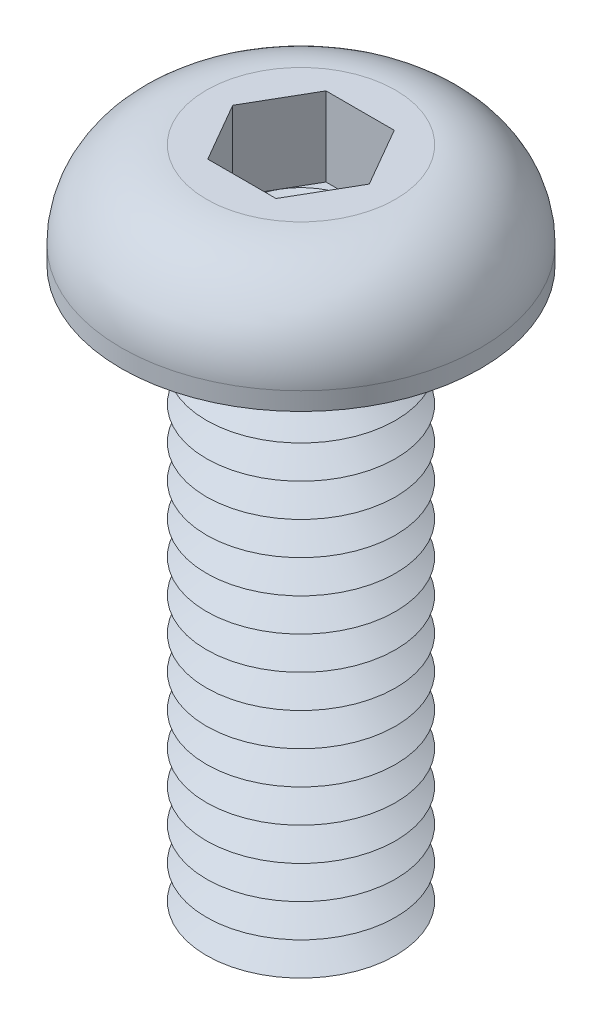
ISO-10303-21;
HEADER;
FILE_DESCRIPTION(('STEP AP214'),'2;1');
FILE_NAME('part.step','',(''),(''),'','','');
FILE_SCHEMA(('AUTOMOTIVE_DESIGN { 1 0 10303 214 1 1 1 1 }'));
ENDSEC;
DATA;
#1=APPLICATION_CONTEXT('core data for automotive mechanical design processes');
#2=APPLICATION_PROTOCOL_DEFINITION('international standard','automotive_design',2000,#1);
#3=PRODUCT_CONTEXT('',#1,'mechanical');
#4=PRODUCT('Part','Part','',(#3));
#5=PRODUCT_RELATED_PRODUCT_CATEGORY('part','',(#4));
#6=PRODUCT_DEFINITION_FORMATION('','',#4);
#7=PRODUCT_DEFINITION_CONTEXT('part definition',#1,'design');
#8=PRODUCT_DEFINITION('design','',#6,#7);
#9=PRODUCT_DEFINITION_SHAPE('','',#8);
#10=(LENGTH_UNIT() NAMED_UNIT(*) SI_UNIT(.MILLI.,.METRE.));
#11=(NAMED_UNIT(*) PLANE_ANGLE_UNIT() SI_UNIT($,.RADIAN.));
#12=(NAMED_UNIT(*) SI_UNIT($,.STERADIAN.) SOLID_ANGLE_UNIT());
#13=UNCERTAINTY_MEASURE_WITH_UNIT(LENGTH_MEASURE(1.E-05),#10,'distance_accuracy_value','');
#14=(GEOMETRIC_REPRESENTATION_CONTEXT(3) GLOBAL_UNCERTAINTY_ASSIGNED_CONTEXT((#13)) GLOBAL_UNIT_ASSIGNED_CONTEXT((#10,
#11,#12)) REPRESENTATION_CONTEXT('',''));
#15=CARTESIAN_POINT('',(0.,0.,0.));
#16=DIRECTION('',(0.,0.,1.));
#17=DIRECTION('',(1.,0.,0.));
#18=AXIS2_PLACEMENT_3D('',#15,#16,#17);
#19=CARTESIAN_POINT('',(0.,0.,0.));
#20=DIRECTION('',(0.,-1.,0.));
#21=DIRECTION('',(0.,0.,-1.));
#22=AXIS2_PLACEMENT_3D('',#19,#20,#21);
#23=TOROIDAL_SURFACE('',#22,2.35,0.35);
#24=CARTESIAN_POINT('',(0.,0.,-2.7));
#25=VERTEX_POINT('',#24);
#26=VERTEX_LOOP('',#25);
#27=FACE_BOUND('',#26,.T.);
#28=ADVANCED_FACE('P0_F12',(#27),#23,.T.);
#29=CLOSED_SHELL('',(#28));
#30=MANIFOLD_SOLID_BREP('P0_B1',#29);
#31=CARTESIAN_POINT('',(0.721687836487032,0.530000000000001,-1.25));
#32=DIRECTION('',(0.,1.,0.));
#33=DIRECTION('',(0.,0.,1.));
#34=AXIS2_PLACEMENT_3D('',#31,#32,#33);
#35=PLANE('',#34);
#36=CARTESIAN_POINT('',(0.,0.530000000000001,0.));
#37=DIRECTION('',(0.,1.,0.));
#38=DIRECTION('',(0.,0.,1.));
#39=AXIS2_PLACEMENT_3D('',#36,#37,#38);
#40=CIRCLE('',#39,1.25);
#41=CARTESIAN_POINT('',(0.,0.530000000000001,1.25));
#42=VERTEX_POINT('',#41);
#43=CARTESIAN_POINT('',(1.08253175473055,0.530000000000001,0.625));
#44=VERTEX_POINT('',#43);
#45=EDGE_CURVE('P1_E93',#42,#44,#40,.T.);
#46=ORIENTED_EDGE('',*,*,#45,.F.);
#47=DIRECTION('',(1.,0.,0.));
#48=VECTOR('',#47,1.);
#49=CARTESIAN_POINT('',(-0.721687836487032,0.530000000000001,1.25));
#50=LINE('',#49,#48);
#51=CARTESIAN_POINT('',(0.721687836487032,0.530000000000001,1.25));
#52=VERTEX_POINT('',#51);
#53=EDGE_CURVE('P1_E116',#42,#52,#50,.T.);
#54=ORIENTED_EDGE('',*,*,#53,.T.);
#55=DIRECTION('',(0.5,0.,-0.866025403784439));
#56=VECTOR('',#55,1.);
#57=CARTESIAN_POINT('',(0.721687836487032,0.530000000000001,1.25));
#58=LINE('',#57,#56);
#59=EDGE_CURVE('P1_E112',#52,#44,#58,.T.);
#60=ORIENTED_EDGE('',*,*,#59,.T.);
#61=EDGE_LOOP('',(#46,#54,#60));
#62=FACE_BOUND('',#61,.T.);
#63=ADVANCED_FACE('P1_F15',(#62),#35,.T.);
#64=CARTESIAN_POINT('',(0.,0.530000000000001,0.));
#65=DIRECTION('',(0.,1.,0.));
#66=DIRECTION('',(0.,0.,1.));
#67=AXIS2_PLACEMENT_3D('',#64,#65,#66);
#68=CIRCLE('',#67,1.25);
#69=CARTESIAN_POINT('',(1.08253175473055,0.530000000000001,-0.625));
#70=VERTEX_POINT('',#69);
#71=EDGE_CURVE('P1_E10',#44,#70,#68,.T.);
#72=ORIENTED_EDGE('',*,*,#71,.F.);
#73=CARTESIAN_POINT('',(1.44337567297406,0.530000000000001,0.));
#74=VERTEX_POINT('',#73);
#75=EDGE_CURVE('P1_E104',#44,#74,#58,.T.);
#76=ORIENTED_EDGE('',*,*,#75,.T.);
#77=DIRECTION('',(-0.5,0.,-0.866025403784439));
#78=VECTOR('',#77,1.);
#79=CARTESIAN_POINT('',(1.44337567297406,0.530000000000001,0.));
#80=LINE('',#79,#78);
#81=EDGE_CURVE('P1_E107',#74,#70,#80,.T.);
#82=ORIENTED_EDGE('',*,*,#81,.T.);
#83=EDGE_LOOP('',(#72,#76,#82));
#84=FACE_BOUND('',#83,.T.);
#85=ADVANCED_FACE('P1_F103',(#84),#35,.T.);
#86=CARTESIAN_POINT('',(0.,0.530000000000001,-1.25));
#87=VERTEX_POINT('',#86);
#88=EDGE_CURVE('P1_E24',#70,#87,#68,.T.);
#89=ORIENTED_EDGE('',*,*,#88,.F.);
#90=CARTESIAN_POINT('',(0.721687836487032,0.530000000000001,-1.25));
#91=VERTEX_POINT('',#90);
#92=EDGE_CURVE('P1_E139',#70,#91,#80,.T.);
#93=ORIENTED_EDGE('',*,*,#92,.T.);
#94=DIRECTION('',(-1.,0.,0.));
#95=VECTOR('',#94,1.);
#96=CARTESIAN_POINT('',(0.721687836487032,0.530000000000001,-1.25));
#97=LINE('',#96,#95);
#98=EDGE_CURVE('P1_E318',#91,#87,#97,.T.);
#99=ORIENTED_EDGE('',*,*,#98,.T.);
#100=EDGE_LOOP('',(#89,#93,#99));
#101=FACE_BOUND('',#100,.T.);
#102=ADVANCED_FACE('P1_F283',(#101),#35,.T.);
#103=CARTESIAN_POINT('',(-1.08253175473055,0.530000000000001,-0.625));
#104=VERTEX_POINT('',#103);
#105=EDGE_CURVE('P1_E313',#87,#104,#68,.T.);
#106=ORIENTED_EDGE('',*,*,#105,.F.);
#107=CARTESIAN_POINT('',(-0.721687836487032,0.530000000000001,-1.25));
#108=VERTEX_POINT('',#107);
#109=EDGE_CURVE('P1_E322',#87,#108,#97,.T.);
#110=ORIENTED_EDGE('',*,*,#109,.T.);
#111=DIRECTION('',(-0.5,0.,0.866025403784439));
#112=VECTOR('',#111,1.);
#113=CARTESIAN_POINT('',(-0.721687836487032,0.530000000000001,-1.25));
#114=LINE('',#113,#112);
#115=EDGE_CURVE('P1_E317',#108,#104,#114,.T.);
#116=ORIENTED_EDGE('',*,*,#115,.T.);
#117=EDGE_LOOP('',(#106,#110,#116));
#118=FACE_BOUND('',#117,.T.);
#119=ADVANCED_FACE('P1_F297',(#118),#35,.T.);
#120=CARTESIAN_POINT('',(-1.08253175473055,0.530000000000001,0.625));
#121=VERTEX_POINT('',#120);
#122=EDGE_CURVE('P1_E31',#104,#121,#68,.T.);
#123=ORIENTED_EDGE('',*,*,#122,.F.);
#124=CARTESIAN_POINT('',(-1.44337567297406,0.530000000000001,0.));
#125=VERTEX_POINT('',#124);
#126=EDGE_CURVE('P1_E309',#104,#125,#114,.T.);
#127=ORIENTED_EDGE('',*,*,#126,.T.);
#128=DIRECTION('',(0.5,0.,0.866025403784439));
#129=VECTOR('',#128,1.);
#130=CARTESIAN_POINT('',(-1.44337567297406,0.530000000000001,0.));
#131=LINE('',#130,#129);
#132=EDGE_CURVE('P1_E312',#125,#121,#131,.T.);
#133=ORIENTED_EDGE('',*,*,#132,.T.);
#134=EDGE_LOOP('',(#123,#127,#133));
#135=FACE_BOUND('',#134,.T.);
#136=ADVANCED_FACE('P1_F288',(#135),#35,.T.);
#137=CARTESIAN_POINT('',(0.,-11.3,0.));
#138=DIRECTION('',(0.,1.,0.));
#139=DIRECTION('',(0.,0.,1.));
#140=AXIS2_PLACEMENT_3D('',#137,#138,#139);
#141=CONICAL_SURFACE('',#140,1.39378221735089,1.0471975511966);
#142=CARTESIAN_POINT('',(0.,-10.95,0.));
#143=DIRECTION('',(0.,-1.,0.));
#144=DIRECTION('',(0.,0.,-1.));
#145=AXIS2_PLACEMENT_3D('',#142,#143,#144);
#146=CIRCLE('',#145,2.);
#147=CARTESIAN_POINT('',(0.,-10.95,-2.));
#148=VERTEX_POINT('',#147);
#149=EDGE_CURVE('P1_E245',#148,#148,#146,.T.);
#150=ORIENTED_EDGE('',*,*,#149,.T.);
#151=EDGE_LOOP('',(#150));
#152=FACE_BOUND('',#151,.T.);
#153=CARTESIAN_POINT('',(0.,-11.3,0.));
#154=DIRECTION('',(0.,-1.,0.));
#155=DIRECTION('',(0.,0.,-1.));
#156=AXIS2_PLACEMENT_3D('',#153,#154,#155);
#157=CIRCLE('',#156,1.39378221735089);
#158=CARTESIAN_POINT('',(0.,-11.3,-1.39378221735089));
#159=VERTEX_POINT('',#158);
#160=EDGE_CURVE('P1_E248',#159,#159,#157,.T.);
#161=ORIENTED_EDGE('',*,*,#160,.F.);
#162=EDGE_LOOP('',(#161));
#163=FACE_BOUND('',#162,.T.);
#164=ADVANCED_FACE('P1_F296',(#152,#163),#141,.T.);
#165=CARTESIAN_POINT('',(0.,-11.65,0.));
#166=DIRECTION('',(0.,-1.,0.));
#167=DIRECTION('',(0.,0.,-1.));
#168=AXIS2_PLACEMENT_3D('',#165,#166,#167);
#169=CONICAL_SURFACE('',#168,2.,1.0471975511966);
#170=ORIENTED_EDGE('',*,*,#160,.T.);
#171=EDGE_LOOP('',(#170));
#172=FACE_BOUND('',#171,.T.);
#173=CARTESIAN_POINT('',(0.,-11.65,0.));
#174=DIRECTION('',(0.,-1.,0.));
#175=DIRECTION('',(0.,0.,-1.));
#176=AXIS2_PLACEMENT_3D('',#173,#174,#175);
#177=CIRCLE('',#176,2.);
#178=CARTESIAN_POINT('',(0.,-11.65,-2.));
#179=VERTEX_POINT('',#178);
#180=EDGE_CURVE('P1_E251',#179,#179,#177,.T.);
#181=ORIENTED_EDGE('',*,*,#180,.F.);
#182=EDGE_LOOP('',(#181));
#183=FACE_BOUND('',#182,.T.);
#184=ADVANCED_FACE('P1_F303',(#172,#183),#169,.T.);
#185=CARTESIAN_POINT('',(0.,-12.,0.));
#186=DIRECTION('',(0.,1.,0.));
#187=DIRECTION('',(0.,0.,1.));
#188=AXIS2_PLACEMENT_3D('',#185,#186,#187);
#189=PLANE('',#188);
#190=CARTESIAN_POINT('',(0.,-12.,0.));
#191=DIRECTION('',(0.,-1.,0.));
#192=DIRECTION('',(0.,0.,-1.));
#193=AXIS2_PLACEMENT_3D('',#190,#191,#192);
#194=CIRCLE('',#193,1.39378221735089);
#195=CARTESIAN_POINT('',(0.,-12.,-1.39378221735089));
#196=VERTEX_POINT('',#195);
#197=EDGE_CURVE('P1_E254',#196,#196,#194,.T.);
#198=ORIENTED_EDGE('',*,*,#197,.T.);
#199=EDGE_LOOP('',(#198));
#200=FACE_BOUND('',#199,.T.);
#201=ADVANCED_FACE('P1_F381',(#200),#189,.F.);
#202=CARTESIAN_POINT('',(0.,-12.,0.));
#203=DIRECTION('',(0.,1.,0.));
#204=DIRECTION('',(0.,0.,1.));
#205=AXIS2_PLACEMENT_3D('',#202,#203,#204);
#206=CONICAL_SURFACE('',#205,1.39378221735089,1.0471975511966);
#207=ORIENTED_EDGE('',*,*,#180,.T.);
#208=EDGE_LOOP('',(#207));
#209=FACE_BOUND('',#208,.T.);
#210=ORIENTED_EDGE('',*,*,#197,.F.);
#211=EDGE_LOOP('',(#210));
#212=FACE_BOUND('',#211,.T.);
#213=ADVANCED_FACE('P1_F392',(#209,#212),#206,.T.);
#214=CARTESIAN_POINT('',(0.,-10.6,0.));
#215=DIRECTION('',(0.,1.,0.));
#216=DIRECTION('',(0.,0.,1.));
#217=AXIS2_PLACEMENT_3D('',#214,#215,#216);
#218=CONICAL_SURFACE('',#217,1.39378221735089,1.0471975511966);
#219=CARTESIAN_POINT('',(0.,-10.25,0.));
#220=DIRECTION('',(0.,-1.,0.));
#221=DIRECTION('',(0.,0.,-1.));
#222=AXIS2_PLACEMENT_3D('',#219,#220,#221);
#223=CIRCLE('',#222,2.);
#224=CARTESIAN_POINT('',(0.,-10.25,-2.));
#225=VERTEX_POINT('',#224);
#226=EDGE_CURVE('P1_E239',#225,#225,#223,.T.);
#227=ORIENTED_EDGE('',*,*,#226,.T.);
#228=EDGE_LOOP('',(#227));
#229=FACE_BOUND('',#228,.T.);
#230=CARTESIAN_POINT('',(0.,-10.6,0.));
#231=DIRECTION('',(0.,-1.,0.));
#232=DIRECTION('',(0.,0.,-1.));
#233=AXIS2_PLACEMENT_3D('',#230,#231,#232);
#234=CIRCLE('',#233,1.39378221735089);
#235=CARTESIAN_POINT('',(0.,-10.6,-1.39378221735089));
#236=VERTEX_POINT('',#235);
#237=EDGE_CURVE('P1_E242',#236,#236,#234,.T.);
#238=ORIENTED_EDGE('',*,*,#237,.F.);
#239=EDGE_LOOP('',(#238));
#240=FACE_BOUND('',#239,.T.);
#241=ADVANCED_FACE('P1_F401',(#229,#240),#218,.T.);
#242=CARTESIAN_POINT('',(0.,-10.95,0.));
#243=DIRECTION('',(0.,-1.,0.));
#244=DIRECTION('',(0.,0.,-1.));
#245=AXIS2_PLACEMENT_3D('',#242,#243,#244);
#246=CONICAL_SURFACE('',#245,2.,1.0471975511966);
#247=ORIENTED_EDGE('',*,*,#237,.T.);
#248=EDGE_LOOP('',(#247));
#249=FACE_BOUND('',#248,.T.);
#250=ORIENTED_EDGE('',*,*,#149,.F.);
#251=EDGE_LOOP('',(#250));
#252=FACE_BOUND('',#251,.T.);
#253=ADVANCED_FACE('P1_F410',(#249,#252),#246,.T.);
#254=CARTESIAN_POINT('',(0.,-9.9,0.));
#255=DIRECTION('',(0.,1.,0.));
#256=DIRECTION('',(0.,0.,1.));
#257=AXIS2_PLACEMENT_3D('',#254,#255,#256);
#258=CONICAL_SURFACE('',#257,1.39378221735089,1.0471975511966);
#259=CARTESIAN_POINT('',(0.,-9.55,0.));
#260=DIRECTION('',(0.,-1.,0.));
#261=DIRECTION('',(0.,0.,-1.));
#262=AXIS2_PLACEMENT_3D('',#259,#260,#261);
#263=CIRCLE('',#262,2.);
#264=CARTESIAN_POINT('',(0.,-9.55,-2.));
#265=VERTEX_POINT('',#264);
#266=EDGE_CURVE('P1_E233',#265,#265,#263,.T.);
#267=ORIENTED_EDGE('',*,*,#266,.T.);
#268=EDGE_LOOP('',(#267));
#269=FACE_BOUND('',#268,.T.);
#270=CARTESIAN_POINT('',(0.,-9.9,0.));
#271=DIRECTION('',(0.,-1.,0.));
#272=DIRECTION('',(0.,0.,-1.));
#273=AXIS2_PLACEMENT_3D('',#270,#271,#272);
#274=CIRCLE('',#273,1.39378221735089);
#275=CARTESIAN_POINT('',(0.,-9.9,-1.39378221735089));
#276=VERTEX_POINT('',#275);
#277=EDGE_CURVE('P1_E236',#276,#276,#274,.T.);
#278=ORIENTED_EDGE('',*,*,#277,.F.);
#279=EDGE_LOOP('',(#278));
#280=FACE_BOUND('',#279,.T.);
#281=ADVANCED_FACE('P1_F420',(#269,#280),#258,.T.);
#282=CARTESIAN_POINT('',(0.,-10.25,0.));
#283=DIRECTION('',(0.,-1.,0.));
#284=DIRECTION('',(0.,0.,-1.));
#285=AXIS2_PLACEMENT_3D('',#282,#283,#284);
#286=CONICAL_SURFACE('',#285,2.,1.0471975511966);
#287=ORIENTED_EDGE('',*,*,#277,.T.);
#288=EDGE_LOOP('',(#287));
#289=FACE_BOUND('',#288,.T.);
#290=ORIENTED_EDGE('',*,*,#226,.F.);
#291=EDGE_LOOP('',(#290));
#292=FACE_BOUND('',#291,.T.);
#293=ADVANCED_FACE('P1_F430',(#289,#292),#286,.T.);
#294=CARTESIAN_POINT('',(0.,-9.2,0.));
#295=DIRECTION('',(0.,1.,0.));
#296=DIRECTION('',(0.,0.,1.));
#297=AXIS2_PLACEMENT_3D('',#294,#295,#296);
#298=CONICAL_SURFACE('',#297,1.39378221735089,1.0471975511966);
#299=CARTESIAN_POINT('',(0.,-8.85,0.));
#300=DIRECTION('',(0.,-1.,0.));
#301=DIRECTION('',(0.,0.,-1.));
#302=AXIS2_PLACEMENT_3D('',#299,#300,#301);
#303=CIRCLE('',#302,2.);
#304=CARTESIAN_POINT('',(0.,-8.85,-2.));
#305=VERTEX_POINT('',#304);
#306=EDGE_CURVE('P1_E227',#305,#305,#303,.T.);
#307=ORIENTED_EDGE('',*,*,#306,.T.);
#308=EDGE_LOOP('',(#307));
#309=FACE_BOUND('',#308,.T.);
#310=CARTESIAN_POINT('',(0.,-9.2,0.));
#311=DIRECTION('',(0.,-1.,0.));
#312=DIRECTION('',(0.,0.,-1.));
#313=AXIS2_PLACEMENT_3D('',#310,#311,#312);
#314=CIRCLE('',#313,1.39378221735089);
#315=CARTESIAN_POINT('',(0.,-9.2,-1.39378221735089));
#316=VERTEX_POINT('',#315);
#317=EDGE_CURVE('P1_E230',#316,#316,#314,.T.);
#318=ORIENTED_EDGE('',*,*,#317,.F.);
#319=EDGE_LOOP('',(#318));
#320=FACE_BOUND('',#319,.T.);
#321=ADVANCED_FACE('P1_F440',(#309,#320),#298,.T.);
#322=CARTESIAN_POINT('',(0.,-9.55,0.));
#323=DIRECTION('',(0.,-1.,0.));
#324=DIRECTION('',(0.,0.,-1.));
#325=AXIS2_PLACEMENT_3D('',#322,#323,#324);
#326=CONICAL_SURFACE('',#325,2.,1.0471975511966);
#327=ORIENTED_EDGE('',*,*,#317,.T.);
#328=EDGE_LOOP('',(#327));
#329=FACE_BOUND('',#328,.T.);
#330=ORIENTED_EDGE('',*,*,#266,.F.);
#331=EDGE_LOOP('',(#330));
#332=FACE_BOUND('',#331,.T.);
#333=ADVANCED_FACE('P1_F450',(#329,#332),#326,.T.);
#334=CARTESIAN_POINT('',(0.,-8.5,0.));
#335=DIRECTION('',(0.,1.,0.));
#336=DIRECTION('',(0.,0.,1.));
#337=AXIS2_PLACEMENT_3D('',#334,#335,#336);
#338=CONICAL_SURFACE('',#337,1.39378221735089,1.0471975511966);
#339=CARTESIAN_POINT('',(0.,-8.15,0.));
#340=DIRECTION('',(0.,-1.,0.));
#341=DIRECTION('',(0.,0.,-1.));
#342=AXIS2_PLACEMENT_3D('',#339,#340,#341);
#343=CIRCLE('',#342,2.);
#344=CARTESIAN_POINT('',(0.,-8.15,-2.));
#345=VERTEX_POINT('',#344);
#346=EDGE_CURVE('P1_E221',#345,#345,#343,.T.);
#347=ORIENTED_EDGE('',*,*,#346,.T.);
#348=EDGE_LOOP('',(#347));
#349=FACE_BOUND('',#348,.T.);
#350=CARTESIAN_POINT('',(0.,-8.5,0.));
#351=DIRECTION('',(0.,-1.,0.));
#352=DIRECTION('',(0.,0.,-1.));
#353=AXIS2_PLACEMENT_3D('',#350,#351,#352);
#354=CIRCLE('',#353,1.39378221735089);
#355=CARTESIAN_POINT('',(0.,-8.5,-1.39378221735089));
#356=VERTEX_POINT('',#355);
#357=EDGE_CURVE('P1_E224',#356,#356,#354,.T.);
#358=ORIENTED_EDGE('',*,*,#357,.F.);
#359=EDGE_LOOP('',(#358));
#360=FACE_BOUND('',#359,.T.);
#361=ADVANCED_FACE('P1_F460',(#349,#360),#338,.T.);
#362=CARTESIAN_POINT('',(0.,-8.85,0.));
#363=DIRECTION('',(0.,-1.,0.));
#364=DIRECTION('',(0.,0.,-1.));
#365=AXIS2_PLACEMENT_3D('',#362,#363,#364);
#366=CONICAL_SURFACE('',#365,2.,1.0471975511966);
#367=ORIENTED_EDGE('',*,*,#357,.T.);
#368=EDGE_LOOP('',(#367));
#369=FACE_BOUND('',#368,.T.);
#370=ORIENTED_EDGE('',*,*,#306,.F.);
#371=EDGE_LOOP('',(#370));
#372=FACE_BOUND('',#371,.T.);
#373=ADVANCED_FACE('P1_F470',(#369,#372),#366,.T.);
#374=CARTESIAN_POINT('',(0.,-7.8,0.));
#375=DIRECTION('',(0.,1.,0.));
#376=DIRECTION('',(0.,0.,1.));
#377=AXIS2_PLACEMENT_3D('',#374,#375,#376);
#378=CONICAL_SURFACE('',#377,1.39378221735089,1.0471975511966);
#379=CARTESIAN_POINT('',(0.,-7.45,0.));
#380=DIRECTION('',(0.,-1.,0.));
#381=DIRECTION('',(0.,0.,-1.));
#382=AXIS2_PLACEMENT_3D('',#379,#380,#381);
#383=CIRCLE('',#382,2.);
#384=CARTESIAN_POINT('',(0.,-7.45,-2.));
#385=VERTEX_POINT('',#384);
#386=EDGE_CURVE('P1_E215',#385,#385,#383,.T.);
#387=ORIENTED_EDGE('',*,*,#386,.T.);
#388=EDGE_LOOP('',(#387));
#389=FACE_BOUND('',#388,.T.);
#390=CARTESIAN_POINT('',(0.,-7.8,0.));
#391=DIRECTION('',(0.,-1.,0.));
#392=DIRECTION('',(0.,0.,-1.));
#393=AXIS2_PLACEMENT_3D('',#390,#391,#392);
#394=CIRCLE('',#393,1.39378221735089);
#395=CARTESIAN_POINT('',(0.,-7.8,-1.39378221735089));
#396=VERTEX_POINT('',#395);
#397=EDGE_CURVE('P1_E218',#396,#396,#394,.T.);
#398=ORIENTED_EDGE('',*,*,#397,.F.);
#399=EDGE_LOOP('',(#398));
#400=FACE_BOUND('',#399,.T.);
#401=ADVANCED_FACE('P1_F480',(#389,#400),#378,.T.);
#402=CARTESIAN_POINT('',(0.,-8.15,0.));
#403=DIRECTION('',(0.,-1.,0.));
#404=DIRECTION('',(0.,0.,-1.));
#405=AXIS2_PLACEMENT_3D('',#402,#403,#404);
#406=CONICAL_SURFACE('',#405,2.,1.0471975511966);
#407=ORIENTED_EDGE('',*,*,#397,.T.);
#408=EDGE_LOOP('',(#407));
#409=FACE_BOUND('',#408,.T.);
#410=ORIENTED_EDGE('',*,*,#346,.F.);
#411=EDGE_LOOP('',(#410));
#412=FACE_BOUND('',#411,.T.);
#413=ADVANCED_FACE('P1_F490',(#409,#412),#406,.T.);
#414=CARTESIAN_POINT('',(0.,-7.1,0.));
#415=DIRECTION('',(0.,1.,0.));
#416=DIRECTION('',(0.,0.,1.));
#417=AXIS2_PLACEMENT_3D('',#414,#415,#416);
#418=CONICAL_SURFACE('',#417,1.39378221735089,1.0471975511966);
#419=CARTESIAN_POINT('',(0.,-6.75,0.));
#420=DIRECTION('',(0.,-1.,0.));
#421=DIRECTION('',(0.,0.,-1.));
#422=AXIS2_PLACEMENT_3D('',#419,#420,#421);
#423=CIRCLE('',#422,2.);
#424=CARTESIAN_POINT('',(0.,-6.75,-2.));
#425=VERTEX_POINT('',#424);
#426=EDGE_CURVE('P1_E209',#425,#425,#423,.T.);
#427=ORIENTED_EDGE('',*,*,#426,.T.);
#428=EDGE_LOOP('',(#427));
#429=FACE_BOUND('',#428,.T.);
#430=CARTESIAN_POINT('',(0.,-7.1,0.));
#431=DIRECTION('',(0.,-1.,0.));
#432=DIRECTION('',(0.,0.,-1.));
#433=AXIS2_PLACEMENT_3D('',#430,#431,#432);
#434=CIRCLE('',#433,1.39378221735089);
#435=CARTESIAN_POINT('',(0.,-7.1,-1.39378221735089));
#436=VERTEX_POINT('',#435);
#437=EDGE_CURVE('P1_E212',#436,#436,#434,.T.);
#438=ORIENTED_EDGE('',*,*,#437,.F.);
#439=EDGE_LOOP('',(#438));
#440=FACE_BOUND('',#439,.T.);
#441=ADVANCED_FACE('P1_F500',(#429,#440),#418,.T.);
#442=CARTESIAN_POINT('',(0.,-7.45,0.));
#443=DIRECTION('',(0.,-1.,0.));
#444=DIRECTION('',(0.,0.,-1.));
#445=AXIS2_PLACEMENT_3D('',#442,#443,#444);
#446=CONICAL_SURFACE('',#445,2.,1.0471975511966);
#447=ORIENTED_EDGE('',*,*,#437,.T.);
#448=EDGE_LOOP('',(#447));
#449=FACE_BOUND('',#448,.T.);
#450=ORIENTED_EDGE('',*,*,#386,.F.);
#451=EDGE_LOOP('',(#450));
#452=FACE_BOUND('',#451,.T.);
#453=ADVANCED_FACE('P1_F510',(#449,#452),#446,.T.);
#454=CARTESIAN_POINT('',(0.,-6.4,0.));
#455=DIRECTION('',(0.,1.,0.));
#456=DIRECTION('',(0.,0.,1.));
#457=AXIS2_PLACEMENT_3D('',#454,#455,#456);
#458=CONICAL_SURFACE('',#457,1.39378221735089,1.0471975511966);
#459=CARTESIAN_POINT('',(0.,-6.05,0.));
#460=DIRECTION('',(0.,-1.,0.));
#461=DIRECTION('',(0.,0.,-1.));
#462=AXIS2_PLACEMENT_3D('',#459,#460,#461);
#463=CIRCLE('',#462,2.);
#464=CARTESIAN_POINT('',(0.,-6.05,-2.));
#465=VERTEX_POINT('',#464);
#466=EDGE_CURVE('P1_E203',#465,#465,#463,.T.);
#467=ORIENTED_EDGE('',*,*,#466,.T.);
#468=EDGE_LOOP('',(#467));
#469=FACE_BOUND('',#468,.T.);
#470=CARTESIAN_POINT('',(0.,-6.4,0.));
#471=DIRECTION('',(0.,-1.,0.));
#472=DIRECTION('',(0.,0.,-1.));
#473=AXIS2_PLACEMENT_3D('',#470,#471,#472);
#474=CIRCLE('',#473,1.39378221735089);
#475=CARTESIAN_POINT('',(0.,-6.4,-1.39378221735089));
#476=VERTEX_POINT('',#475);
#477=EDGE_CURVE('P1_E206',#476,#476,#474,.T.);
#478=ORIENTED_EDGE('',*,*,#477,.F.);
#479=EDGE_LOOP('',(#478));
#480=FACE_BOUND('',#479,.T.);
#481=ADVANCED_FACE('P1_F520',(#469,#480),#458,.T.);
#482=CARTESIAN_POINT('',(0.,-6.75,0.));
#483=DIRECTION('',(0.,-1.,0.));
#484=DIRECTION('',(0.,0.,-1.));
#485=AXIS2_PLACEMENT_3D('',#482,#483,#484);
#486=CONICAL_SURFACE('',#485,2.,1.0471975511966);
#487=ORIENTED_EDGE('',*,*,#477,.T.);
#488=EDGE_LOOP('',(#487));
#489=FACE_BOUND('',#488,.T.);
#490=ORIENTED_EDGE('',*,*,#426,.F.);
#491=EDGE_LOOP('',(#490));
#492=FACE_BOUND('',#491,.T.);
#493=ADVANCED_FACE('P1_F530',(#489,#492),#486,.T.);
#494=CARTESIAN_POINT('',(0.,-5.7,0.));
#495=DIRECTION('',(0.,1.,0.));
#496=DIRECTION('',(0.,0.,1.));
#497=AXIS2_PLACEMENT_3D('',#494,#495,#496);
#498=CONICAL_SURFACE('',#497,1.39378221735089,1.0471975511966);
#499=CARTESIAN_POINT('',(0.,-5.35,0.));
#500=DIRECTION('',(0.,-1.,0.));
#501=DIRECTION('',(0.,0.,-1.));
#502=AXIS2_PLACEMENT_3D('',#499,#500,#501);
#503=CIRCLE('',#502,2.);
#504=CARTESIAN_POINT('',(0.,-5.35,-2.));
#505=VERTEX_POINT('',#504);
#506=EDGE_CURVE('P1_E197',#505,#505,#503,.T.);
#507=ORIENTED_EDGE('',*,*,#506,.T.);
#508=EDGE_LOOP('',(#507));
#509=FACE_BOUND('',#508,.T.);
#510=CARTESIAN_POINT('',(0.,-5.7,0.));
#511=DIRECTION('',(0.,-1.,0.));
#512=DIRECTION('',(0.,0.,-1.));
#513=AXIS2_PLACEMENT_3D('',#510,#511,#512);
#514=CIRCLE('',#513,1.39378221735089);
#515=CARTESIAN_POINT('',(0.,-5.7,-1.39378221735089));
#516=VERTEX_POINT('',#515);
#517=EDGE_CURVE('P1_E200',#516,#516,#514,.T.);
#518=ORIENTED_EDGE('',*,*,#517,.F.);
#519=EDGE_LOOP('',(#518));
#520=FACE_BOUND('',#519,.T.);
#521=ADVANCED_FACE('P1_F540',(#509,#520),#498,.T.);
#522=CARTESIAN_POINT('',(0.,-6.05,0.));
#523=DIRECTION('',(0.,-1.,0.));
#524=DIRECTION('',(0.,0.,-1.));
#525=AXIS2_PLACEMENT_3D('',#522,#523,#524);
#526=CONICAL_SURFACE('',#525,2.,1.0471975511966);
#527=ORIENTED_EDGE('',*,*,#517,.T.);
#528=EDGE_LOOP('',(#527));
#529=FACE_BOUND('',#528,.T.);
#530=ORIENTED_EDGE('',*,*,#466,.F.);
#531=EDGE_LOOP('',(#530));
#532=FACE_BOUND('',#531,.T.);
#533=ADVANCED_FACE('P1_F550',(#529,#532),#526,.T.);
#534=CARTESIAN_POINT('',(0.,-5.,0.));
#535=DIRECTION('',(0.,1.,0.));
#536=DIRECTION('',(0.,0.,1.));
#537=AXIS2_PLACEMENT_3D('',#534,#535,#536);
#538=CONICAL_SURFACE('',#537,1.39378221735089,1.0471975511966);
#539=CARTESIAN_POINT('',(0.,-4.65,0.));
#540=DIRECTION('',(0.,-1.,0.));
#541=DIRECTION('',(0.,0.,-1.));
#542=AXIS2_PLACEMENT_3D('',#539,#540,#541);
#543=CIRCLE('',#542,2.);
#544=CARTESIAN_POINT('',(0.,-4.65,-2.));
#545=VERTEX_POINT('',#544);
#546=EDGE_CURVE('P1_E191',#545,#545,#543,.T.);
#547=ORIENTED_EDGE('',*,*,#546,.T.);
#548=EDGE_LOOP('',(#547));
#549=FACE_BOUND('',#548,.T.);
#550=CARTESIAN_POINT('',(0.,-5.,0.));
#551=DIRECTION('',(0.,-1.,0.));
#552=DIRECTION('',(0.,0.,-1.));
#553=AXIS2_PLACEMENT_3D('',#550,#551,#552);
#554=CIRCLE('',#553,1.39378221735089);
#555=CARTESIAN_POINT('',(0.,-5.,-1.39378221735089));
#556=VERTEX_POINT('',#555);
#557=EDGE_CURVE('P1_E194',#556,#556,#554,.T.);
#558=ORIENTED_EDGE('',*,*,#557,.F.);
#559=EDGE_LOOP('',(#558));
#560=FACE_BOUND('',#559,.T.);
#561=ADVANCED_FACE('P1_F560',(#549,#560),#538,.T.);
#562=CARTESIAN_POINT('',(0.,-5.35,0.));
#563=DIRECTION('',(0.,-1.,0.));
#564=DIRECTION('',(0.,0.,-1.));
#565=AXIS2_PLACEMENT_3D('',#562,#563,#564);
#566=CONICAL_SURFACE('',#565,2.,1.0471975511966);
#567=ORIENTED_EDGE('',*,*,#557,.T.);
#568=EDGE_LOOP('',(#567));
#569=FACE_BOUND('',#568,.T.);
#570=ORIENTED_EDGE('',*,*,#506,.F.);
#571=EDGE_LOOP('',(#570));
#572=FACE_BOUND('',#571,.T.);
#573=ADVANCED_FACE('P1_F570',(#569,#572),#566,.T.);
#574=CARTESIAN_POINT('',(0.,-4.3,0.));
#575=DIRECTION('',(0.,1.,0.));
#576=DIRECTION('',(0.,0.,1.));
#577=AXIS2_PLACEMENT_3D('',#574,#575,#576);
#578=CONICAL_SURFACE('',#577,1.39378221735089,1.0471975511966);
#579=CARTESIAN_POINT('',(0.,-3.95,0.));
#580=DIRECTION('',(0.,-1.,0.));
#581=DIRECTION('',(0.,0.,-1.));
#582=AXIS2_PLACEMENT_3D('',#579,#580,#581);
#583=CIRCLE('',#582,2.);
#584=CARTESIAN_POINT('',(0.,-3.95,-2.));
#585=VERTEX_POINT('',#584);
#586=EDGE_CURVE('P1_E185',#585,#585,#583,.T.);
#587=ORIENTED_EDGE('',*,*,#586,.T.);
#588=EDGE_LOOP('',(#587));
#589=FACE_BOUND('',#588,.T.);
#590=CARTESIAN_POINT('',(0.,-4.3,0.));
#591=DIRECTION('',(0.,-1.,0.));
#592=DIRECTION('',(0.,0.,-1.));
#593=AXIS2_PLACEMENT_3D('',#590,#591,#592);
#594=CIRCLE('',#593,1.39378221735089);
#595=CARTESIAN_POINT('',(0.,-4.3,-1.39378221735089));
#596=VERTEX_POINT('',#595);
#597=EDGE_CURVE('P1_E188',#596,#596,#594,.T.);
#598=ORIENTED_EDGE('',*,*,#597,.F.);
#599=EDGE_LOOP('',(#598));
#600=FACE_BOUND('',#599,.T.);
#601=ADVANCED_FACE('P1_F580',(#589,#600),#578,.T.);
#602=CARTESIAN_POINT('',(0.,-4.65,0.));
#603=DIRECTION('',(0.,-1.,0.));
#604=DIRECTION('',(0.,0.,-1.));
#605=AXIS2_PLACEMENT_3D('',#602,#603,#604);
#606=CONICAL_SURFACE('',#605,2.,1.0471975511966);
#607=ORIENTED_EDGE('',*,*,#597,.T.);
#608=EDGE_LOOP('',(#607));
#609=FACE_BOUND('',#608,.T.);
#610=ORIENTED_EDGE('',*,*,#546,.F.);
#611=EDGE_LOOP('',(#610));
#612=FACE_BOUND('',#611,.T.);
#613=ADVANCED_FACE('P1_F590',(#609,#612),#606,.T.);
#614=CARTESIAN_POINT('',(0.,-3.6,0.));
#615=DIRECTION('',(0.,1.,0.));
#616=DIRECTION('',(0.,0.,1.));
#617=AXIS2_PLACEMENT_3D('',#614,#615,#616);
#618=CONICAL_SURFACE('',#617,1.39378221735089,1.0471975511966);
#619=CARTESIAN_POINT('',(0.,-3.25,0.));
#620=DIRECTION('',(0.,-1.,0.));
#621=DIRECTION('',(0.,0.,-1.));
#622=AXIS2_PLACEMENT_3D('',#619,#620,#621);
#623=CIRCLE('',#622,2.);
#624=CARTESIAN_POINT('',(0.,-3.25,-2.));
#625=VERTEX_POINT('',#624);
#626=EDGE_CURVE('P1_E179',#625,#625,#623,.T.);
#627=ORIENTED_EDGE('',*,*,#626,.T.);
#628=EDGE_LOOP('',(#627));
#629=FACE_BOUND('',#628,.T.);
#630=CARTESIAN_POINT('',(0.,-3.6,0.));
#631=DIRECTION('',(0.,-1.,0.));
#632=DIRECTION('',(0.,0.,-1.));
#633=AXIS2_PLACEMENT_3D('',#630,#631,#632);
#634=CIRCLE('',#633,1.39378221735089);
#635=CARTESIAN_POINT('',(0.,-3.6,-1.39378221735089));
#636=VERTEX_POINT('',#635);
#637=EDGE_CURVE('P1_E182',#636,#636,#634,.T.);
#638=ORIENTED_EDGE('',*,*,#637,.F.);
#639=EDGE_LOOP('',(#638));
#640=FACE_BOUND('',#639,.T.);
#641=ADVANCED_FACE('P1_F600',(#629,#640),#618,.T.);
#642=CARTESIAN_POINT('',(0.,-3.95,0.));
#643=DIRECTION('',(0.,-1.,0.));
#644=DIRECTION('',(0.,0.,-1.));
#645=AXIS2_PLACEMENT_3D('',#642,#643,#644);
#646=CONICAL_SURFACE('',#645,2.,1.0471975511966);
#647=ORIENTED_EDGE('',*,*,#637,.T.);
#648=EDGE_LOOP('',(#647));
#649=FACE_BOUND('',#648,.T.);
#650=ORIENTED_EDGE('',*,*,#586,.F.);
#651=EDGE_LOOP('',(#650));
#652=FACE_BOUND('',#651,.T.);
#653=ADVANCED_FACE('P1_F610',(#649,#652),#646,.T.);
#654=CARTESIAN_POINT('',(0.,-2.9,0.));
#655=DIRECTION('',(0.,1.,0.));
#656=DIRECTION('',(0.,0.,1.));
#657=AXIS2_PLACEMENT_3D('',#654,#655,#656);
#658=CONICAL_SURFACE('',#657,1.39378221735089,1.0471975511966);
#659=CARTESIAN_POINT('',(0.,-2.55,0.));
#660=DIRECTION('',(0.,-1.,0.));
#661=DIRECTION('',(0.,0.,-1.));
#662=AXIS2_PLACEMENT_3D('',#659,#660,#661);
#663=CIRCLE('',#662,2.);
#664=CARTESIAN_POINT('',(0.,-2.55,-2.));
#665=VERTEX_POINT('',#664);
#666=EDGE_CURVE('P1_E173',#665,#665,#663,.T.);
#667=ORIENTED_EDGE('',*,*,#666,.T.);
#668=EDGE_LOOP('',(#667));
#669=FACE_BOUND('',#668,.T.);
#670=CARTESIAN_POINT('',(0.,-2.9,0.));
#671=DIRECTION('',(0.,-1.,0.));
#672=DIRECTION('',(0.,0.,-1.));
#673=AXIS2_PLACEMENT_3D('',#670,#671,#672);
#674=CIRCLE('',#673,1.39378221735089);
#675=CARTESIAN_POINT('',(0.,-2.9,-1.39378221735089));
#676=VERTEX_POINT('',#675);
#677=EDGE_CURVE('P1_E176',#676,#676,#674,.T.);
#678=ORIENTED_EDGE('',*,*,#677,.F.);
#679=EDGE_LOOP('',(#678));
#680=FACE_BOUND('',#679,.T.);
#681=ADVANCED_FACE('P1_F620',(#669,#680),#658,.T.);
#682=CARTESIAN_POINT('',(0.,-3.25,0.));
#683=DIRECTION('',(0.,-1.,0.));
#684=DIRECTION('',(0.,0.,-1.));
#685=AXIS2_PLACEMENT_3D('',#682,#683,#684);
#686=CONICAL_SURFACE('',#685,2.,1.0471975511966);
#687=ORIENTED_EDGE('',*,*,#677,.T.);
#688=EDGE_LOOP('',(#687));
#689=FACE_BOUND('',#688,.T.);
#690=ORIENTED_EDGE('',*,*,#626,.F.);
#691=EDGE_LOOP('',(#690));
#692=FACE_BOUND('',#691,.T.);
#693=ADVANCED_FACE('P1_F630',(#689,#692),#686,.T.);
#694=CARTESIAN_POINT('',(0.,-2.2,0.));
#695=DIRECTION('',(0.,1.,0.));
#696=DIRECTION('',(0.,0.,1.));
#697=AXIS2_PLACEMENT_3D('',#694,#695,#696);
#698=CONICAL_SURFACE('',#697,1.39378221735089,1.0471975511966);
#699=CARTESIAN_POINT('',(0.,-1.85,0.));
#700=DIRECTION('',(0.,-1.,0.));
#701=DIRECTION('',(0.,0.,-1.));
#702=AXIS2_PLACEMENT_3D('',#699,#700,#701);
#703=CIRCLE('',#702,2.);
#704=CARTESIAN_POINT('',(0.,-1.85,-2.));
#705=VERTEX_POINT('',#704);
#706=EDGE_CURVE('P1_E164',#705,#705,#703,.T.);
#707=ORIENTED_EDGE('',*,*,#706,.T.);
#708=EDGE_LOOP('',(#707));
#709=FACE_BOUND('',#708,.T.);
#710=CARTESIAN_POINT('',(0.,-2.2,0.));
#711=DIRECTION('',(0.,-1.,0.));
#712=DIRECTION('',(0.,0.,-1.));
#713=AXIS2_PLACEMENT_3D('',#710,#711,#712);
#714=CIRCLE('',#713,1.39378221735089);
#715=CARTESIAN_POINT('',(0.,-2.2,-1.39378221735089));
#716=VERTEX_POINT('',#715);
#717=EDGE_CURVE('P1_E170',#716,#716,#714,.T.);
#718=ORIENTED_EDGE('',*,*,#717,.F.);
#719=EDGE_LOOP('',(#718));
#720=FACE_BOUND('',#719,.T.);
#721=ADVANCED_FACE('P1_F640',(#709,#720),#698,.T.);
#722=CARTESIAN_POINT('',(0.,-2.55,0.));
#723=DIRECTION('',(0.,-1.,0.));
#724=DIRECTION('',(0.,0.,-1.));
#725=AXIS2_PLACEMENT_3D('',#722,#723,#724);
#726=CONICAL_SURFACE('',#725,2.,1.0471975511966);
#727=ORIENTED_EDGE('',*,*,#717,.T.);
#728=EDGE_LOOP('',(#727));
#729=FACE_BOUND('',#728,.T.);
#730=ORIENTED_EDGE('',*,*,#666,.F.);
#731=EDGE_LOOP('',(#730));
#732=FACE_BOUND('',#731,.T.);
#733=ADVANCED_FACE('P1_F650',(#729,#732),#726,.T.);
#734=CARTESIAN_POINT('',(0.,-1.5,0.));
#735=DIRECTION('',(0.,1.,0.));
#736=DIRECTION('',(0.,0.,1.));
#737=AXIS2_PLACEMENT_3D('',#734,#735,#736);
#738=CONICAL_SURFACE('',#737,1.39378221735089,1.0471975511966);
#739=CARTESIAN_POINT('',(0.,-1.15,0.));
#740=DIRECTION('',(0.,-1.,0.));
#741=DIRECTION('',(0.,0.,-1.));
#742=AXIS2_PLACEMENT_3D('',#739,#740,#741);
#743=CIRCLE('',#742,2.);
#744=CARTESIAN_POINT('',(0.,-1.15,-2.));
#745=VERTEX_POINT('',#744);
#746=EDGE_CURVE('P1_E167',#745,#745,#743,.T.);
#747=ORIENTED_EDGE('',*,*,#746,.T.);
#748=EDGE_LOOP('',(#747));
#749=FACE_BOUND('',#748,.T.);
#750=CARTESIAN_POINT('',(0.,-1.5,0.));
#751=DIRECTION('',(0.,-1.,0.));
#752=DIRECTION('',(0.,0.,-1.));
#753=AXIS2_PLACEMENT_3D('',#750,#751,#752);
#754=CIRCLE('',#753,1.39378221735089);
#755=CARTESIAN_POINT('',(0.,-1.5,-1.39378221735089));
#756=VERTEX_POINT('',#755);
#757=EDGE_CURVE('P1_E161',#756,#756,#754,.T.);
#758=ORIENTED_EDGE('',*,*,#757,.F.);
#759=EDGE_LOOP('',(#758));
#760=FACE_BOUND('',#759,.T.);
#761=ADVANCED_FACE('P1_F660',(#749,#760),#738,.T.);
#762=CARTESIAN_POINT('',(0.,-1.85,0.));
#763=DIRECTION('',(0.,-1.,0.));
#764=DIRECTION('',(0.,0.,-1.));
#765=AXIS2_PLACEMENT_3D('',#762,#763,#764);
#766=CONICAL_SURFACE('',#765,2.,1.0471975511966);
#767=ORIENTED_EDGE('',*,*,#757,.T.);
#768=EDGE_LOOP('',(#767));
#769=FACE_BOUND('',#768,.T.);
#770=ORIENTED_EDGE('',*,*,#706,.F.);
#771=EDGE_LOOP('',(#770));
#772=FACE_BOUND('',#771,.T.);
#773=ADVANCED_FACE('P1_F670',(#769,#772),#766,.T.);
#774=CARTESIAN_POINT('',(0.,-12.,0.));
#775=DIRECTION('',(0.,1.,0.));
#776=DIRECTION('',(0.,0.,1.));
#777=AXIS2_PLACEMENT_3D('',#774,#775,#776);
#778=CYLINDRICAL_SURFACE('',#777,2.);
#779=CARTESIAN_POINT('',(0.,0.,0.));
#780=DIRECTION('',(0.,-1.,0.));
#781=DIRECTION('',(1.,0.,0.));
#782=AXIS2_PLACEMENT_3D('',#779,#780,#781);
#783=CIRCLE('',#782,2.);
#784=CARTESIAN_POINT('',(2.,0.,0.));
#785=VERTEX_POINT('',#784);
#786=EDGE_CURVE('P1_E141',#785,#785,#783,.F.);
#787=ORIENTED_EDGE('',*,*,#786,.F.);
#788=EDGE_LOOP('',(#787));
#789=FACE_BOUND('',#788,.T.);
#790=ORIENTED_EDGE('',*,*,#746,.F.);
#791=EDGE_LOOP('',(#790));
#792=FACE_BOUND('',#791,.T.);
#793=ADVANCED_FACE('P1_F17',(#789,#792),#778,.T.);
#794=CARTESIAN_POINT('',(0.,0.,0.));
#795=DIRECTION('',(0.,-1.,0.));
#796=DIRECTION('',(0.,0.,-1.));
#797=AXIS2_PLACEMENT_3D('',#794,#795,#796);
#798=TOROIDAL_SURFACE('',#797,2.35,0.35);
#799=ORIENTED_EDGE('',*,*,#786,.T.);
#800=EDGE_LOOP('',(#799));
#801=FACE_BOUND('',#800,.T.);
#802=CARTESIAN_POINT('',(0.,0.,0.));
#803=DIRECTION('',(0.,1.,0.));
#804=DIRECTION('',(-1.,0.,0.));
#805=AXIS2_PLACEMENT_3D('',#802,#803,#804);
#806=CIRCLE('',#805,2.7);
#807=CARTESIAN_POINT('',(-2.7,0.,0.));
#808=VERTEX_POINT('',#807);
#809=EDGE_CURVE('P1_E151',#808,#808,#806,.F.);
#810=ORIENTED_EDGE('',*,*,#809,.T.);
#811=EDGE_LOOP('',(#810));
#812=FACE_BOUND('',#811,.T.);
#813=ADVANCED_FACE('P1_F259',(#801,#812),#798,.F.);
#814=CARTESIAN_POINT('',(2.,2.2,0.));
#815=DIRECTION('',(0.,-1.,0.));
#816=DIRECTION('',(1.,0.,0.));
#817=AXIS2_PLACEMENT_3D('',#814,#815,#816);
#818=PLANE('',#817);
#819=DIRECTION('',(-1.,0.,0.));
#820=VECTOR('',#819,1.);
#821=CARTESIAN_POINT('',(0.721687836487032,2.2,-1.25));
#822=LINE('',#821,#820);
#823=CARTESIAN_POINT('',(0.721687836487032,2.2,-1.25));
#824=VERTEX_POINT('',#823);
#825=CARTESIAN_POINT('',(-0.721687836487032,2.2,-1.25));
#826=VERTEX_POINT('',#825);
#827=EDGE_CURVE('P1_E125',#824,#826,#822,.T.);
#828=ORIENTED_EDGE('',*,*,#827,.F.);
#829=DIRECTION('',(-0.5,0.,-0.866025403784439));
#830=VECTOR('',#829,1.);
#831=CARTESIAN_POINT('',(1.44337567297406,2.2,0.));
#832=LINE('',#831,#830);
#833=CARTESIAN_POINT('',(1.44337567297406,2.2,0.));
#834=VERTEX_POINT('',#833);
#835=EDGE_CURVE('P1_E39',#834,#824,#832,.T.);
#836=ORIENTED_EDGE('',*,*,#835,.F.);
#837=DIRECTION('',(0.5,0.,-0.866025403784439));
#838=VECTOR('',#837,1.);
#839=CARTESIAN_POINT('',(0.721687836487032,2.2,1.25));
#840=LINE('',#839,#838);
#841=CARTESIAN_POINT('',(0.721687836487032,2.2,1.25));
#842=VERTEX_POINT('',#841);
#843=EDGE_CURVE('P1_E137',#842,#834,#840,.T.);
#844=ORIENTED_EDGE('',*,*,#843,.F.);
#845=DIRECTION('',(1.,0.,0.));
#846=VECTOR('',#845,1.);
#847=CARTESIAN_POINT('',(-0.721687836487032,2.2,1.25));
#848=LINE('',#847,#846);
#849=CARTESIAN_POINT('',(-0.721687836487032,2.2,1.25));
#850=VERTEX_POINT('',#849);
#851=EDGE_CURVE('P1_E134',#850,#842,#848,.T.);
#852=ORIENTED_EDGE('',*,*,#851,.F.);
#853=DIRECTION('',(0.5,0.,0.866025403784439));
#854=VECTOR('',#853,1.);
#855=CARTESIAN_POINT('',(-1.44337567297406,2.2,0.));
#856=LINE('',#855,#854);
#857=CARTESIAN_POINT('',(-1.44337567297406,2.2,0.));
#858=VERTEX_POINT('',#857);
#859=EDGE_CURVE('P1_E131',#858,#850,#856,.T.);
#860=ORIENTED_EDGE('',*,*,#859,.F.);
#861=DIRECTION('',(-0.5,0.,0.866025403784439));
#862=VECTOR('',#861,1.);
#863=CARTESIAN_POINT('',(-0.721687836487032,2.2,-1.25));
#864=LINE('',#863,#862);
#865=EDGE_CURVE('P1_E128',#826,#858,#864,.T.);
#866=ORIENTED_EDGE('',*,*,#865,.F.);
#867=EDGE_LOOP('',(#828,#836,#844,#852,#860,#866));
#868=FACE_BOUND('',#867,.T.);
#869=CARTESIAN_POINT('',(0.,2.2,0.));
#870=DIRECTION('',(0.,1.,0.));
#871=DIRECTION('',(-1.,0.,0.));
#872=AXIS2_PLACEMENT_3D('',#869,#870,#871);
#873=CIRCLE('',#872,2.);
#874=CARTESIAN_POINT('',(-2.,2.2,0.));
#875=VERTEX_POINT('',#874);
#876=EDGE_CURVE('P1_E152',#875,#875,#873,.T.);
#877=ORIENTED_EDGE('',*,*,#876,.T.);
#878=EDGE_LOOP('',(#877));
#879=FACE_BOUND('',#878,.T.);
#880=ADVANCED_FACE('P1_F337',(#868,#879),#818,.F.);
#881=CARTESIAN_POINT('',(0.,0.38,0.));
#882=DIRECTION('',(0.,1.,0.));
#883=DIRECTION('',(-1.,0.,0.));
#884=AXIS2_PLACEMENT_3D('',#881,#882,#883);
#885=TOROIDAL_SURFACE('',#884,1.97988888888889,1.82011111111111);
#886=ORIENTED_EDGE('',*,*,#876,.F.);
#887=EDGE_LOOP('',(#886));
#888=FACE_BOUND('',#887,.T.);
#889=CARTESIAN_POINT('',(0.,0.38,0.));
#890=DIRECTION('',(0.,1.,0.));
#891=DIRECTION('',(-1.,0.,0.));
#892=AXIS2_PLACEMENT_3D('',#889,#890,#891);
#893=CIRCLE('',#892,3.8);
#894=CARTESIAN_POINT('',(-3.8,0.38,0.));
#895=VERTEX_POINT('',#894);
#896=EDGE_CURVE('P1_E155',#895,#895,#893,.T.);
#897=ORIENTED_EDGE('',*,*,#896,.T.);
#898=EDGE_LOOP('',(#897));
#899=FACE_BOUND('',#898,.T.);
#900=ADVANCED_FACE('P1_F273',(#888,#899),#885,.T.);
#901=CARTESIAN_POINT('',(0.,2.2,0.));
#902=DIRECTION('',(0.,1.,0.));
#903=DIRECTION('',(-1.,0.,0.));
#904=AXIS2_PLACEMENT_3D('',#901,#902,#903);
#905=CYLINDRICAL_SURFACE('',#904,3.8);
#906=ORIENTED_EDGE('',*,*,#896,.F.);
#907=EDGE_LOOP('',(#906));
#908=FACE_BOUND('',#907,.T.);
#909=CARTESIAN_POINT('',(0.,0.,0.));
#910=DIRECTION('',(0.,1.,0.));
#911=DIRECTION('',(-1.,0.,0.));
#912=AXIS2_PLACEMENT_3D('',#909,#910,#911);
#913=CIRCLE('',#912,3.8);
#914=CARTESIAN_POINT('',(-3.8,0.,0.));
#915=VERTEX_POINT('',#914);
#916=EDGE_CURVE('P1_E158',#915,#915,#913,.T.);
#917=ORIENTED_EDGE('',*,*,#916,.T.);
#918=EDGE_LOOP('',(#917));
#919=FACE_BOUND('',#918,.T.);
#920=ADVANCED_FACE('P1_F264',(#908,#919),#905,.T.);
#921=CARTESIAN_POINT('',(0.,0.,0.));
#922=DIRECTION('',(0.,1.,0.));
#923=DIRECTION('',(-1.,0.,0.));
#924=AXIS2_PLACEMENT_3D('',#921,#922,#923);
#925=PLANE('',#924);
#926=ORIENTED_EDGE('',*,*,#916,.F.);
#927=EDGE_LOOP('',(#926));
#928=FACE_BOUND('',#927,.T.);
#929=ORIENTED_EDGE('',*,*,#809,.F.);
#930=EDGE_LOOP('',(#929));
#931=FACE_BOUND('',#930,.T.);
#932=ADVANCED_FACE('P1_F261',(#928,#931),#925,.F.);
#933=CARTESIAN_POINT('',(1.44337567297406,0.530000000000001,0.));
#934=DIRECTION('',(0.866025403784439,0.,-0.5));
#935=DIRECTION('',(-0.5,0.,-0.866025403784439));
#936=AXIS2_PLACEMENT_3D('',#933,#934,#935);
#937=PLANE('',#936);
#938=ORIENTED_EDGE('',*,*,#835,.T.);
#939=DIRECTION('',(0.,1.,0.));
#940=VECTOR('',#939,1.);
#941=CARTESIAN_POINT('',(0.721687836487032,0.530000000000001,-1.25));
#942=LINE('',#941,#940);
#943=EDGE_CURVE('P1_E118',#91,#824,#942,.T.);
#944=ORIENTED_EDGE('',*,*,#943,.F.);
#945=ORIENTED_EDGE('',*,*,#92,.F.);
#946=ORIENTED_EDGE('',*,*,#81,.F.);
#947=DIRECTION('',(0.,1.,0.));
#948=VECTOR('',#947,1.);
#949=CARTESIAN_POINT('',(1.44337567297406,0.530000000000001,0.));
#950=LINE('',#949,#948);
#951=EDGE_CURVE('P1_E113',#74,#834,#950,.T.);
#952=ORIENTED_EDGE('',*,*,#951,.T.);
#953=EDGE_LOOP('',(#938,#944,#945,#946,#952));
#954=FACE_BOUND('',#953,.T.);
#955=ADVANCED_FACE('P1_F263',(#954),#937,.F.);
#956=CARTESIAN_POINT('',(0.721687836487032,0.530000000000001,1.25));
#957=DIRECTION('',(0.866025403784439,0.,0.5));
#958=DIRECTION('',(0.5,0.,-0.866025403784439));
#959=AXIS2_PLACEMENT_3D('',#956,#957,#958);
#960=PLANE('',#959);
#961=ORIENTED_EDGE('',*,*,#843,.T.);
#962=ORIENTED_EDGE('',*,*,#951,.F.);
#963=ORIENTED_EDGE('',*,*,#75,.F.);
#964=ORIENTED_EDGE('',*,*,#59,.F.);
#965=DIRECTION('',(0.,1.,0.));
#966=VECTOR('',#965,1.);
#967=CARTESIAN_POINT('',(0.721687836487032,0.530000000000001,1.25));
#968=LINE('',#967,#966);
#969=EDGE_CURVE('P1_E142',#52,#842,#968,.T.);
#970=ORIENTED_EDGE('',*,*,#969,.T.);
#971=EDGE_LOOP('',(#961,#962,#963,#964,#970));
#972=FACE_BOUND('',#971,.T.);
#973=ADVANCED_FACE('P1_F111',(#972),#960,.F.);
#974=CARTESIAN_POINT('',(-0.721687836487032,0.530000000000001,1.25));
#975=DIRECTION('',(0.,0.,1.));
#976=DIRECTION('',(1.,0.,0.));
#977=AXIS2_PLACEMENT_3D('',#974,#975,#976);
#978=PLANE('',#977);
#979=ORIENTED_EDGE('',*,*,#851,.T.);
#980=ORIENTED_EDGE('',*,*,#969,.F.);
#981=ORIENTED_EDGE('',*,*,#53,.F.);
#982=CARTESIAN_POINT('',(-0.721687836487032,0.530000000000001,1.25));
#983=VERTEX_POINT('',#982);
#984=EDGE_CURVE('P1_E114',#983,#42,#50,.T.);
#985=ORIENTED_EDGE('',*,*,#984,.F.);
#986=DIRECTION('',(0.,1.,0.));
#987=VECTOR('',#986,1.);
#988=CARTESIAN_POINT('',(-0.721687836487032,0.530000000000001,1.25));
#989=LINE('',#988,#987);
#990=EDGE_CURVE('P1_E144',#983,#850,#989,.T.);
#991=ORIENTED_EDGE('',*,*,#990,.T.);
#992=EDGE_LOOP('',(#979,#980,#981,#985,#991));
#993=FACE_BOUND('',#992,.T.);
#994=ADVANCED_FACE('P1_F332',(#993),#978,.F.);
#995=CARTESIAN_POINT('',(-1.44337567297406,0.530000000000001,0.));
#996=DIRECTION('',(-0.866025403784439,0.,0.5));
#997=DIRECTION('',(0.5,0.,0.866025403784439));
#998=AXIS2_PLACEMENT_3D('',#995,#996,#997);
#999=PLANE('',#998);
#1000=ORIENTED_EDGE('',*,*,#859,.T.);
#1001=ORIENTED_EDGE('',*,*,#990,.F.);
#1002=EDGE_CURVE('P1_E324',#121,#983,#131,.T.);
#1003=ORIENTED_EDGE('',*,*,#1002,.F.);
#1004=ORIENTED_EDGE('',*,*,#132,.F.);
#1005=DIRECTION('',(0.,1.,0.));
#1006=VECTOR('',#1005,1.);
#1007=CARTESIAN_POINT('',(-1.44337567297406,0.530000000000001,0.));
#1008=LINE('',#1007,#1006);
#1009=EDGE_CURVE('P1_E146',#125,#858,#1008,.T.);
#1010=ORIENTED_EDGE('',*,*,#1009,.T.);
#1011=EDGE_LOOP('',(#1000,#1001,#1003,#1004,#1010));
#1012=FACE_BOUND('',#1011,.T.);
#1013=ADVANCED_FACE('P1_F748',(#1012),#999,.F.);
#1014=CARTESIAN_POINT('',(-0.721687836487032,0.530000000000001,-1.25));
#1015=DIRECTION('',(-0.866025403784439,0.,-0.5));
#1016=DIRECTION('',(-0.5,0.,0.866025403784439));
#1017=AXIS2_PLACEMENT_3D('',#1014,#1015,#1016);
#1018=PLANE('',#1017);
#1019=ORIENTED_EDGE('',*,*,#865,.T.);
#1020=ORIENTED_EDGE('',*,*,#1009,.F.);
#1021=ORIENTED_EDGE('',*,*,#126,.F.);
#1022=ORIENTED_EDGE('',*,*,#115,.F.);
#1023=DIRECTION('',(0.,1.,0.));
#1024=VECTOR('',#1023,1.);
#1025=CARTESIAN_POINT('',(-0.721687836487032,0.530000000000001,-1.25));
#1026=LINE('',#1025,#1024);
#1027=EDGE_CURVE('P1_E119',#108,#826,#1026,.T.);
#1028=ORIENTED_EDGE('',*,*,#1027,.T.);
#1029=EDGE_LOOP('',(#1019,#1020,#1021,#1022,#1028));
#1030=FACE_BOUND('',#1029,.T.);
#1031=ADVANCED_FACE('P1_F292',(#1030),#1018,.F.);
#1032=CARTESIAN_POINT('',(0.721687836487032,0.530000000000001,-1.25));
#1033=DIRECTION('',(0.,0.,-1.));
#1034=DIRECTION('',(-1.,0.,0.));
#1035=AXIS2_PLACEMENT_3D('',#1032,#1033,#1034);
#1036=PLANE('',#1035);
#1037=ORIENTED_EDGE('',*,*,#827,.T.);
#1038=ORIENTED_EDGE('',*,*,#1027,.F.);
#1039=ORIENTED_EDGE('',*,*,#109,.F.);
#1040=ORIENTED_EDGE('',*,*,#98,.F.);
#1041=ORIENTED_EDGE('',*,*,#943,.T.);
#1042=EDGE_LOOP('',(#1037,#1038,#1039,#1040,#1041));
#1043=FACE_BOUND('',#1042,.T.);
#1044=ADVANCED_FACE('P1_F286',(#1043),#1036,.F.);
#1045=EDGE_CURVE('P1_E19',#121,#42,#68,.T.);
#1046=ORIENTED_EDGE('',*,*,#1045,.F.);
#1047=ORIENTED_EDGE('',*,*,#1002,.T.);
#1048=ORIENTED_EDGE('',*,*,#984,.T.);
#1049=EDGE_LOOP('',(#1046,#1047,#1048));
#1050=FACE_BOUND('',#1049,.T.);
#1051=ADVANCED_FACE('P1_F90',(#1050),#35,.T.);
#1052=CARTESIAN_POINT('',(0.,0.530000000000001,0.));
#1053=DIRECTION('',(0.,1.,0.));
#1054=DIRECTION('',(0.,0.,1.));
#1055=AXIS2_PLACEMENT_3D('',#1052,#1053,#1054);
#1056=CONICAL_SURFACE('',#1055,1.25,1.0471975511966);
#1057=CARTESIAN_POINT('',(0.,-0.191687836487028,0.));
#1058=VERTEX_POINT('',#1057);
#1059=VERTEX_LOOP('',#1058);
#1060=FACE_BOUND('',#1059,.T.);
#1061=ORIENTED_EDGE('',*,*,#45,.T.);
#1062=ORIENTED_EDGE('',*,*,#71,.T.);
#1063=ORIENTED_EDGE('',*,*,#88,.T.);
#1064=ORIENTED_EDGE('',*,*,#105,.T.);
#1065=ORIENTED_EDGE('',*,*,#122,.T.);
#1066=ORIENTED_EDGE('',*,*,#1045,.T.);
#1067=EDGE_LOOP('',(#1061,#1062,#1063,#1064,#1065,#1066));
#1068=FACE_BOUND('',#1067,.T.);
#1069=ADVANCED_FACE('P1_F88',(#1060,#1068),#1056,.F.);
#1070=CLOSED_SHELL('',(#63,#85,#102,#119,#136,#164,#184,#201,#213,#241,#253,#281,#293,#321,#333,
#361,#373,#401,#413,#441,#453,#481,#493,#521,#533,#561,#573,#601,#613,#641,#653,#681,#693,#721,
#733,#761,#773,#793,#813,#880,#900,#920,#932,#955,#973,#994,#1013,#1031,#1044,#1051,#1069));
#1071=MANIFOLD_SOLID_BREP('P1_B1',#1070);
#1072=ADVANCED_BREP_SHAPE_REPRESENTATION('',(#18,#30,#1071),#14);
#1073=SHAPE_DEFINITION_REPRESENTATION(#9,#1072);
ENDSEC;
END-ISO-10303-21;
